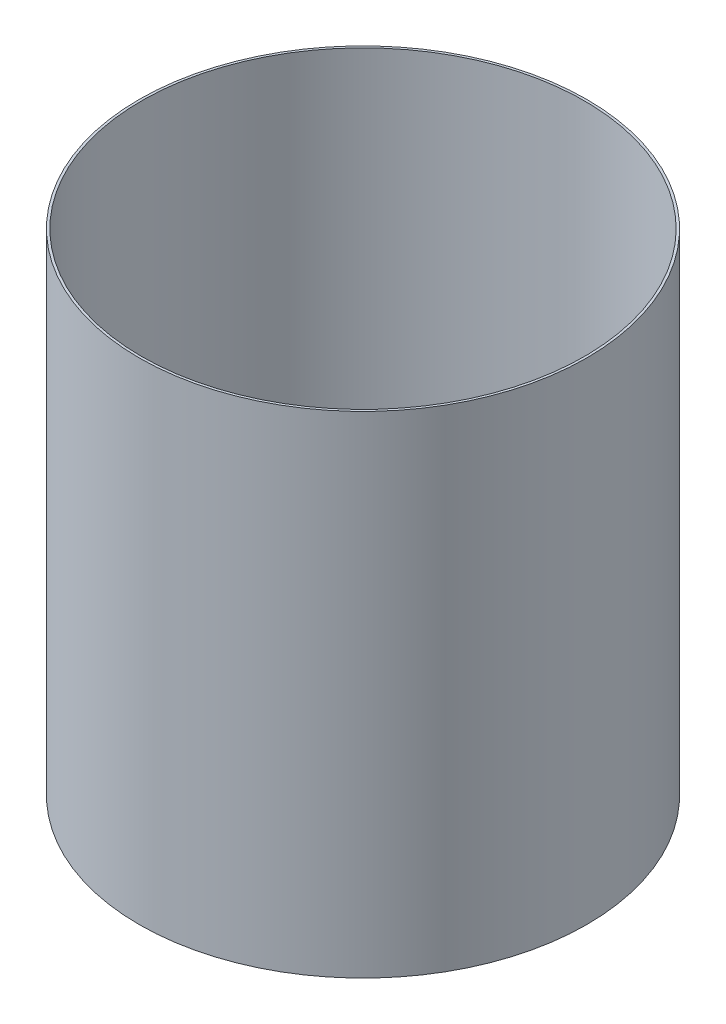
ISO-10303-21;
HEADER;
FILE_DESCRIPTION(('STEP AP214'),'2;1');
FILE_NAME('part.step','',(''),(''),'','','');
FILE_SCHEMA(('AUTOMOTIVE_DESIGN { 1 0 10303 214 1 1 1 1 }'));
ENDSEC;
DATA;
#1=APPLICATION_CONTEXT('core data for automotive mechanical design processes');
#2=APPLICATION_PROTOCOL_DEFINITION('international standard','automotive_design',2000,#1);
#3=PRODUCT_CONTEXT('',#1,'mechanical');
#4=PRODUCT('Part','Part','',(#3));
#5=PRODUCT_RELATED_PRODUCT_CATEGORY('part','',(#4));
#6=PRODUCT_DEFINITION_FORMATION('','',#4);
#7=PRODUCT_DEFINITION_CONTEXT('part definition',#1,'design');
#8=PRODUCT_DEFINITION('design','',#6,#7);
#9=PRODUCT_DEFINITION_SHAPE('','',#8);
#10=(LENGTH_UNIT() NAMED_UNIT(*) SI_UNIT(.MILLI.,.METRE.));
#11=(NAMED_UNIT(*) PLANE_ANGLE_UNIT() SI_UNIT($,.RADIAN.));
#12=(NAMED_UNIT(*) SI_UNIT($,.STERADIAN.) SOLID_ANGLE_UNIT());
#13=UNCERTAINTY_MEASURE_WITH_UNIT(LENGTH_MEASURE(1.E-05),#10,'distance_accuracy_value','');
#14=(GEOMETRIC_REPRESENTATION_CONTEXT(3) GLOBAL_UNCERTAINTY_ASSIGNED_CONTEXT((#13)) GLOBAL_UNIT_ASSIGNED_CONTEXT((#10,
#11,#12)) REPRESENTATION_CONTEXT('',''));
#15=CARTESIAN_POINT('',(0.,0.,0.));
#16=DIRECTION('',(0.,0.,1.));
#17=DIRECTION('',(1.,0.,0.));
#18=AXIS2_PLACEMENT_3D('',#15,#16,#17);
#19=CARTESIAN_POINT('',(0.,87.6487556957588,0.));
#20=DIRECTION('',(0.,1.,0.));
#21=DIRECTION('',(0.,0.,1.));
#22=AXIS2_PLACEMENT_3D('',#19,#20,#21);
#23=CYLINDRICAL_SURFACE('',#22,93.5);
#24=CARTESIAN_POINT('',(0.,-135.469895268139,0.));
#25=DIRECTION('',(0.,1.,0.));
#26=DIRECTION('',(0.,0.,1.));
#27=AXIS2_PLACEMENT_3D('',#24,#25,#26);
#28=CIRCLE('',#27,93.5);
#29=CARTESIAN_POINT('',(0.,-135.469895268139,93.5));
#30=VERTEX_POINT('',#29);
#31=EDGE_CURVE('E44',#30,#30,#28,.T.);
#32=ORIENTED_EDGE('',*,*,#31,.T.);
#33=EDGE_LOOP('',(#32));
#34=FACE_BOUND('',#33,.T.);
#35=CARTESIAN_POINT('',(0.,69.5301047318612,0.));
#36=DIRECTION('',(0.,1.,0.));
#37=DIRECTION('',(0.,0.,1.));
#38=AXIS2_PLACEMENT_3D('',#35,#36,#37);
#39=CIRCLE('',#38,93.5);
#40=CARTESIAN_POINT('',(0.,69.5301047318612,93.5));
#41=VERTEX_POINT('',#40);
#42=EDGE_CURVE('E10',#41,#41,#39,.T.);
#43=ORIENTED_EDGE('',*,*,#42,.F.);
#44=EDGE_LOOP('',(#43));
#45=FACE_BOUND('',#44,.T.);
#46=ADVANCED_FACE('F30',(#34,#45),#23,.T.);
#47=CARTESIAN_POINT('',(-93.5,69.5301047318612,0.));
#48=DIRECTION('',(0.,-1.,0.));
#49=DIRECTION('',(0.,0.,-1.));
#50=AXIS2_PLACEMENT_3D('',#47,#48,#49);
#51=PLANE('',#50);
#52=CARTESIAN_POINT('',(0.,69.5301047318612,0.));
#53=DIRECTION('',(0.,1.,0.));
#54=DIRECTION('',(0.,0.,1.));
#55=AXIS2_PLACEMENT_3D('',#52,#53,#54);
#56=CIRCLE('',#55,92.5);
#57=CARTESIAN_POINT('',(0.,69.5301047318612,92.5));
#58=VERTEX_POINT('',#57);
#59=EDGE_CURVE('E36',#58,#58,#56,.T.);
#60=ORIENTED_EDGE('',*,*,#59,.F.);
#61=EDGE_LOOP('',(#60));
#62=FACE_BOUND('',#61,.T.);
#63=ORIENTED_EDGE('',*,*,#42,.T.);
#64=EDGE_LOOP('',(#63));
#65=FACE_BOUND('',#64,.T.);
#66=ADVANCED_FACE('F60',(#62,#65),#51,.F.);
#67=CARTESIAN_POINT('',(0.,87.6487556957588,0.));
#68=DIRECTION('',(0.,1.,0.));
#69=DIRECTION('',(0.,0.,1.));
#70=AXIS2_PLACEMENT_3D('',#67,#68,#69);
#71=CYLINDRICAL_SURFACE('',#70,92.5);
#72=CARTESIAN_POINT('',(0.,-135.469895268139,0.));
#73=DIRECTION('',(0.,1.,0.));
#74=DIRECTION('',(0.,0.,1.));
#75=AXIS2_PLACEMENT_3D('',#72,#73,#74);
#76=CIRCLE('',#75,92.5);
#77=CARTESIAN_POINT('',(0.,-135.469895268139,92.5));
#78=VERTEX_POINT('',#77);
#79=EDGE_CURVE('E40',#78,#78,#76,.T.);
#80=ORIENTED_EDGE('',*,*,#79,.F.);
#81=EDGE_LOOP('',(#80));
#82=FACE_BOUND('',#81,.T.);
#83=ORIENTED_EDGE('',*,*,#59,.T.);
#84=EDGE_LOOP('',(#83));
#85=FACE_BOUND('',#84,.T.);
#86=ADVANCED_FACE('F55',(#82,#85),#71,.F.);
#87=CARTESIAN_POINT('',(-92.5,-135.469895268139,0.));
#88=DIRECTION('',(0.,1.,0.));
#89=DIRECTION('',(0.,0.,1.));
#90=AXIS2_PLACEMENT_3D('',#87,#88,#89);
#91=PLANE('',#90);
#92=ORIENTED_EDGE('',*,*,#31,.F.);
#93=EDGE_LOOP('',(#92));
#94=FACE_BOUND('',#93,.T.);
#95=ORIENTED_EDGE('',*,*,#79,.T.);
#96=EDGE_LOOP('',(#95));
#97=FACE_BOUND('',#96,.T.);
#98=ADVANCED_FACE('F52',(#94,#97),#91,.F.);
#99=CLOSED_SHELL('',(#46,#66,#86,#98));
#100=MANIFOLD_SOLID_BREP('B2',#99);
#101=ADVANCED_BREP_SHAPE_REPRESENTATION('',(#18,#100),#14);
#102=SHAPE_DEFINITION_REPRESENTATION(#9,#101);
ENDSEC;
END-ISO-10303-21;
